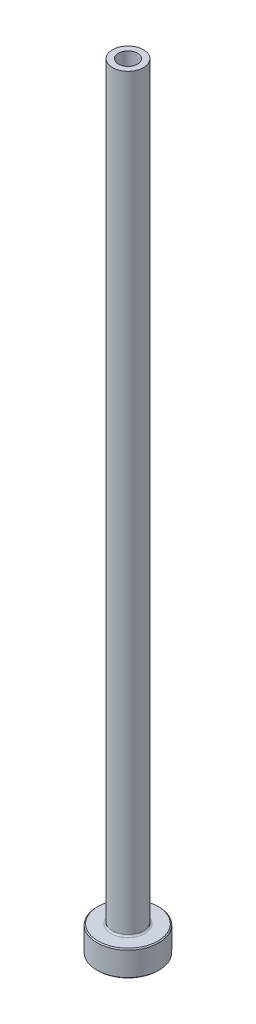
from build123d import *

# Parameters (mm, degrees)
FILLET1_R     = 0.3
CHAMFER1_SIZE = 0.2
CHAMFER3_SIZE = 0.5


with BuildPart() as part:
    # Sketch1 → Revolve1 (revolve)
    with BuildSketch(Plane.XY, mode=Mode.PRIVATE) as revolve1_sk:
        Polygon((-1.85, 150), (-3, 150), (-3, 5), (-6, 5), (-6, 0), (-2.1, 0), (-2.1, 93), (-1.85, 105), align=None)
    revolve(revolve1_sk.sketch.rotate(Axis((0, 92.187680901, 0), (0, -1, 0)), 270), axis=Axis((0, 92.187680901, 0), (0, -1, 0)))

    # Fillet1
    fillet1_edges = [part.edges().sort_by_distance(p)[0] for p in [
        (0, 5, -3),
    ]]
    fillet(fillet1_edges, radius=FILLET1_R)

    # Chamfer1
    chamfer1_edges = [part.edges().sort_by_distance(p)[0] for p in [
        (0, 0, -6),
        (0, 5, -6),
    ]]
    chamfer(chamfer1_edges, length=CHAMFER1_SIZE)

    # Chamfer3
    chamfer3_edges = [part.edges().sort_by_distance(p)[0] for p in [
        (0, 0, -2.1),
    ]]
    chamfer(chamfer3_edges, length=CHAMFER3_SIZE)


solid = part.part
